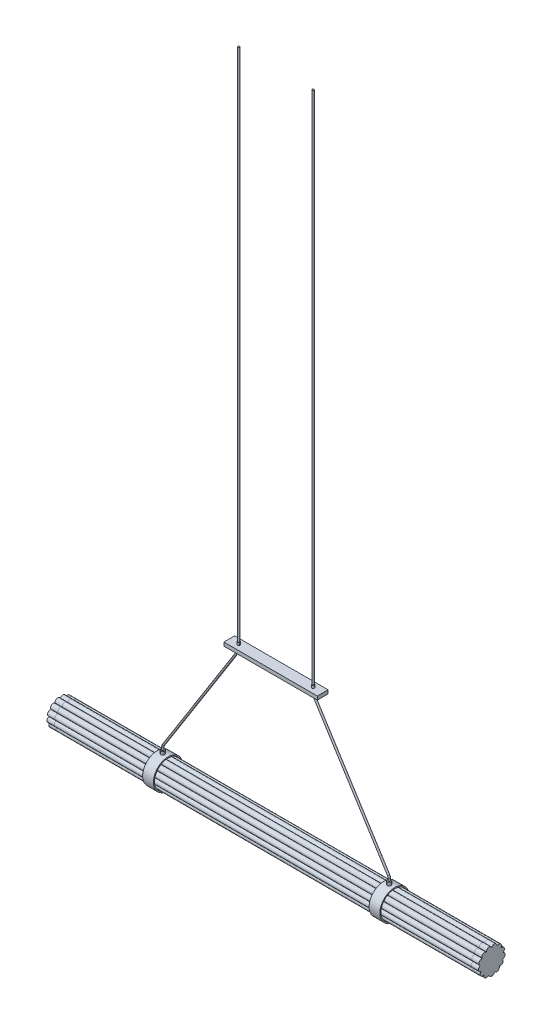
from build123d import *

# Parameters (mm, degrees)
SALIENTE_EXTRUIR1_DEPTH        = 580
SALIENTE_EXTRUIR1_DEPTH_BACK   = 580
SALIENTE_EXTRUIR2_DEPTH        = 580
SALIENTE_EXTRUIR2_DEPTH_BACK   = 580
CROQUIS3_R                     = 7.5
SALIENTE_EXTRUIR3_DEPTH        = 20
CROQUIS5_R                     = 41
CROQUIS5_R_2                   = 38
SALIENTE_EXTRUIR4_DEPTH        = 30
CROQUIS6_W                     = 260
CROQUIS6_H                     = 30
CROQUIS6_R                     = 3.5
SALIENTE_EXTRUIR5_DEPTH        = 10
CROQUIS7_R                     = 5
SALIENTE_EXTRUIR6_DEPTH        = 10
SALIENTE_EXTRUIR7_DEPTH        = 7
SALIENTE_EXTRUIR7_DEPTH_BACK   = 10
CROQUIS8_R                     = 3.5
CROQUIS8_R_2                   = 2.5
SALIENTE_EXTRUIR7_2_DEPTH      = 7
SALIENTE_EXTRUIR7_2_DEPTH_BACK = 10
CORTAR_EXTRUIR5_DEPTH          = 105
CORTAR_EXTRUIR5_DEPTH_BACK     = 105
CROQUIS10_R                    = 1.5
CROQUIS11_R                    = 1.5
SALIENTE_EXTRUIR8_DEPTH        = 2
CHAFL_N1_SIZE                  = 1
VACIADO1_T                     = -1
BARRER3_PROFILE_R              = 2.5


with BuildPart() as part:
    # Croquis2 → Saliente-Extruir1 (new, two sides: drawn at the far end of the back side and taken through both)
    with BuildSketch(Plane(origin=(0, 0, 0), x_dir=(0, 0, -1), z_dir=(1, 0, 0)).offset(-SALIENTE_EXTRUIR1_DEPTH_BACK)):
        with BuildLine():
            ThreePointArc((7.489959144, -30.387958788), (0, -22.5), (-7.489959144, -30.387958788))
            ThreePointArc((-7.489959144, -30.387958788), (-17.427118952, -33.204600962), (-20.754018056, -23.426443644))
            ThreePointArc((-20.754018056, -23.426443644), (-30.861894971, -21.302428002), (-29.263581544, -11.098212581))
            ThreePointArc((-29.263581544, -11.098212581), (-37.226582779, -4.52012551), (-31.069211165, 3.772485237))
            ThreePointArc((-31.069211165, 3.772485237), (-35.063109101, 13.297683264), (-25.757258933, 17.77895215))
            ThreePointArc((-25.757258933, 17.77895215), (-24.867099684, 28.069153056), (-14.544629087, 27.712475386))
            ThreePointArc((-14.544629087, 27.712475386), (-8.974337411, 36.410318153), (0, 31.297404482))
            ThreePointArc((0, 31.297404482), (8.974337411, 36.410318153), (14.544629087, 27.712475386))
            ThreePointArc((14.544629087, 27.712475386), (24.867099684, 28.069153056), (25.757258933, 17.77895215))
            ThreePointArc((25.757258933, 17.77895215), (35.063109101, 13.297683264), (31.069211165, 3.772485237))
            ThreePointArc((31.069211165, 3.772485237), (37.226582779, -4.52012551), (29.263581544, -11.098212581))
            ThreePointArc((29.263581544, -11.098212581), (30.861894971, -21.302428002), (20.754018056, -23.426443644))
            ThreePointArc((20.754018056, -23.426443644), (17.427118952, -33.204600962), (7.489959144, -30.387958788))
        make_face()
    extrude(amount=SALIENTE_EXTRUIR1_DEPTH + SALIENTE_EXTRUIR1_DEPTH_BACK)


with BuildPart() as body_2:
    # Croquis3 → Saliente-Extruir2 (new, two sides: drawn at the far end of the back side and taken through both)
    with BuildSketch(Plane(origin=(0, 0, 0), x_dir=(0, 0, -1), z_dir=(1, 0, 0)).offset(-SALIENTE_EXTRUIR2_DEPTH_BACK)):
        with Locations((0, -30)):
            Circle(CROQUIS3_R)
    extrude(amount=SALIENTE_EXTRUIR2_DEPTH + SALIENTE_EXTRUIR2_DEPTH_BACK)


with BuildPart() as body_3:
    # Croquis4 → Saliente-Extruir3 (new body)
    with BuildSketch(Plane.ZY.offset(580)):
        with BuildLine():
            ThreePointArc((-7.489959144, -30.387958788), (0, -37.5), (7.489959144, -30.387958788))
            ThreePointArc((7.489959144, -30.387958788), (17.427118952, -33.204600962), (20.754018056, -23.426443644))
            ThreePointArc((20.754018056, -23.426443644), (30.861894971, -21.302428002), (29.263581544, -11.098212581))
            ThreePointArc((29.263581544, -11.098212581), (37.226582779, -4.52012551), (31.069211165, 3.772485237))
            ThreePointArc((31.069211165, 3.772485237), (35.063109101, 13.297683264), (25.757258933, 17.77895215))
            ThreePointArc((25.757258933, 17.77895215), (24.867099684, 28.069153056), (14.544629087, 27.712475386))
            ThreePointArc((14.544629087, 27.712475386), (8.974337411, 36.410318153), (0, 31.297404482))
            ThreePointArc((0, 31.297404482), (-8.974337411, 36.410318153), (-14.544629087, 27.712475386))
            ThreePointArc((-14.544629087, 27.712475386), (-24.867099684, 28.069153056), (-25.757258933, 17.77895215))
            ThreePointArc((-25.757258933, 17.77895215), (-35.063109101, 13.297683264), (-31.069211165, 3.772485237))
            ThreePointArc((-31.069211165, 3.772485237), (-37.226582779, -4.52012551), (-29.263581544, -11.098212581))
            ThreePointArc((-29.263581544, -11.098212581), (-30.861894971, -21.302428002), (-20.754018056, -23.426443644))
            ThreePointArc((-20.754018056, -23.426443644), (-17.427118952, -33.204600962), (-7.489959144, -30.387958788))
        make_face()
    extrude(amount=SALIENTE_EXTRUIR3_DEPTH)


with BuildPart() as body_4:
    # Simetr_a2: mirrored copy
    add(body_3.part.mirror(Plane(origin=(0, 0, 0), x_dir=(0, 0, 1), z_dir=(1, 0, 0))))


with BuildPart() as body_5:
    # Croquis5 → Saliente-Extruir4 (new body)
    with BuildSketch(Plane(origin=(300, 0, 0), x_dir=(0, 0, -1), z_dir=(1, 0, 0))):
        Circle(CROQUIS5_R)
        Circle(CROQUIS5_R_2, mode=Mode.SUBTRACT)
    extrude(amount=SALIENTE_EXTRUIR4_DEPTH)


with BuildPart() as body_6:
    # Simetr_a3: mirrored copy
    add(body_5.part.mirror(Plane(origin=(0, 0, 0), x_dir=(0, 0, 1), z_dir=(1, 0, 0))))


with BuildPart() as body_7:
    # Croquis6 → Saliente-Extruir5 (new body)
    with BuildSketch(Plane(origin=(0, 400, 0), x_dir=(1, 0, 0), z_dir=(0, 1, 0))):
        Rectangle(CROQUIS6_W, CROQUIS6_H)
        with Locations(Location((103.5, 0, 0), (0, 0, 270))):
            Circle(CROQUIS6_R, mode=Mode.SUBTRACT)
        with Locations(Location((-103.5, 0, 0), (0, 0, 270))):
            Circle(CROQUIS6_R, mode=Mode.SUBTRACT)
    extrude(amount=SALIENTE_EXTRUIR5_DEPTH)


with BuildPart() as body_5_1:
    add(body_5.part)

    add(body_6.part)  # Saliente-Extruir6 merges body 6
    # Croquis7 → Saliente-Extruir6 (add)
    with BuildSketch(Plane(origin=(0, 40, 0), x_dir=(1, 0, 0), z_dir=(0, 1, 0))):
        with Locations(Location((315, 0, 0), (0, 0, 90))):
            Circle(CROQUIS7_R)
        with Locations(Location((-315, 0, 0), (0, 0, 90))):
            Circle(CROQUIS7_R)
    extrude(amount=SALIENTE_EXTRUIR6_DEPTH)


with BuildPart() as body_7_2:
    # Croquis8 → Saliente-Extruir7 (new, two sides: drawn at the far end of the back side and taken through both)
    with BuildSketch(Plane(origin=(0, 410, 0), x_dir=(1, 0, 0), z_dir=(0, 1, 0)).offset(-SALIENTE_EXTRUIR7_DEPTH_BACK)):
        with Locations(Location((103.5, 0, 0), (0, 0, 270))):
            Circle(CROQUIS8_R)
        with Locations(Location((103.5, 0, 0), (0, 0, 270))):
            Circle(CROQUIS8_R_2, mode=Mode.SUBTRACT)
    extrude(amount=SALIENTE_EXTRUIR7_DEPTH + SALIENTE_EXTRUIR7_DEPTH_BACK)


with BuildPart() as body_8:
    # Croquis8 → Saliente-Extruir7 2 (new, two sides: drawn at the far end of the back side and taken through both)
    with BuildSketch(Plane(origin=(0, 410, 0), x_dir=(1, 0, 0), z_dir=(0, 1, 0)).offset(-SALIENTE_EXTRUIR7_2_DEPTH_BACK)):
        with Locations(Location((-103.5, 0, 0), (0, 0, 270))):
            Circle(CROQUIS8_R)
        with Locations(Location((-103.5, 0, 0), (0, 0, 270))):
            Circle(CROQUIS8_R_2, mode=Mode.SUBTRACT)
    extrude(amount=SALIENTE_EXTRUIR7_2_DEPTH + SALIENTE_EXTRUIR7_2_DEPTH_BACK)


with BuildPart() as cortar_extruir5_tool:
    # Croquis10 → Cortar-Extruir5 (new, two sides: drawn at the far end of the back side and taken through both)
    with BuildSketch(Plane(origin=(0, 0, 0), x_dir=(0, 0, -1), z_dir=(1, 0, 0)).offset(-CORTAR_EXTRUIR5_DEPTH_BACK)):
        with Locations(Location((0, 412.5, 0), (0, 0, 180))):
            Circle(CROQUIS10_R)
    extrude(amount=CORTAR_EXTRUIR5_DEPTH + CORTAR_EXTRUIR5_DEPTH_BACK)


with BuildPart() as body_7_2_1:
    add(body_7_2.part)

    # Cortar-Extruir5: cut by cortar_extruir5_tool
    add(cortar_extruir5_tool.part, mode=Mode.SUBTRACT)


with BuildPart() as body_8_1:
    add(body_8.part)

    # Cortar-Extruir5: cut by cortar_extruir5_tool
    add(cortar_extruir5_tool.part, mode=Mode.SUBTRACT)


with BuildPart() as body_9:
    # Croquis11 → Saliente-Extruir8 (new body)
    with BuildSketch(Plane(origin=(100, 0, 0), x_dir=(0, 0, -1), z_dir=(1, 0, 0))):
        with Locations((0, 412.5)):
            Circle(CROQUIS11_R)
    extrude(amount=SALIENTE_EXTRUIR8_DEPTH)

    # Chafl_n1
    chafl_n1_edges = [body_9.edges().sort_by_distance(p)[0] for p in [
        (102, 412.5, 1.5),
    ]]
    chamfer(chafl_n1_edges, length=CHAFL_N1_SIZE)

    # Vaciado1
    vaciado1_openings = [body_9.faces().sort_by_distance(p)[0] for p in [
        (100, 412.5, 0),
    ]]
    offset(amount=VACIADO1_T, openings=vaciado1_openings, kind=Kind.INTERSECTION)


with BuildPart() as body_10:
    # Simetr_a5: mirrored copy
    add(body_9.part.mirror(Plane(origin=(0, 0, 0), x_dir=(0, 0, 1), z_dir=(1, 0, 0))))


with BuildPart() as body_11:
    # Barrer3: sweep along a path in Croquis12
    with BuildLine(Plane.XY) as barrer3_path:
        Line((-315, 50), (-315, 57.107408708))
        ThreePointArc((-315, 57.107408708), (-314.606192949, 59.886087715), (-313.455788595, 62.445914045))
        Line((-313.455788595, 62.445914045), (-105.044211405, 392.554085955))
        ThreePointArc((-105.044211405, 392.554085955), (-103.893807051, 395.113912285), (-103.5, 397.892591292))
        Line((-103.5, 397.892591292), (-103.5, 400))
        Line((-103.5, 400), (-103.5, 1850))
    # Barrer3 profile (on start of the path) → Barrer3 (sweep)
    with BuildSketch(Plane(origin=(-315, 50, 0), x_dir=(1, 0, 0), z_dir=(0, 1, 0))):
        Circle(BARRER3_PROFILE_R)
    sweep(path=barrer3_path.line)


with BuildPart() as body_12:
    # Simetr_a8: mirrored copy
    add(body_11.part.mirror(Plane(origin=(0, 0, 0), x_dir=(0, 0, 1), z_dir=(1, 0, 0))))


solid = Compound([part.part, body_2.part, body_3.part, body_4.part, body_7.part, body_5_1.part, body_7_2_1.part, body_8_1.part, body_9.part, body_10.part, body_11.part, body_12.part])
